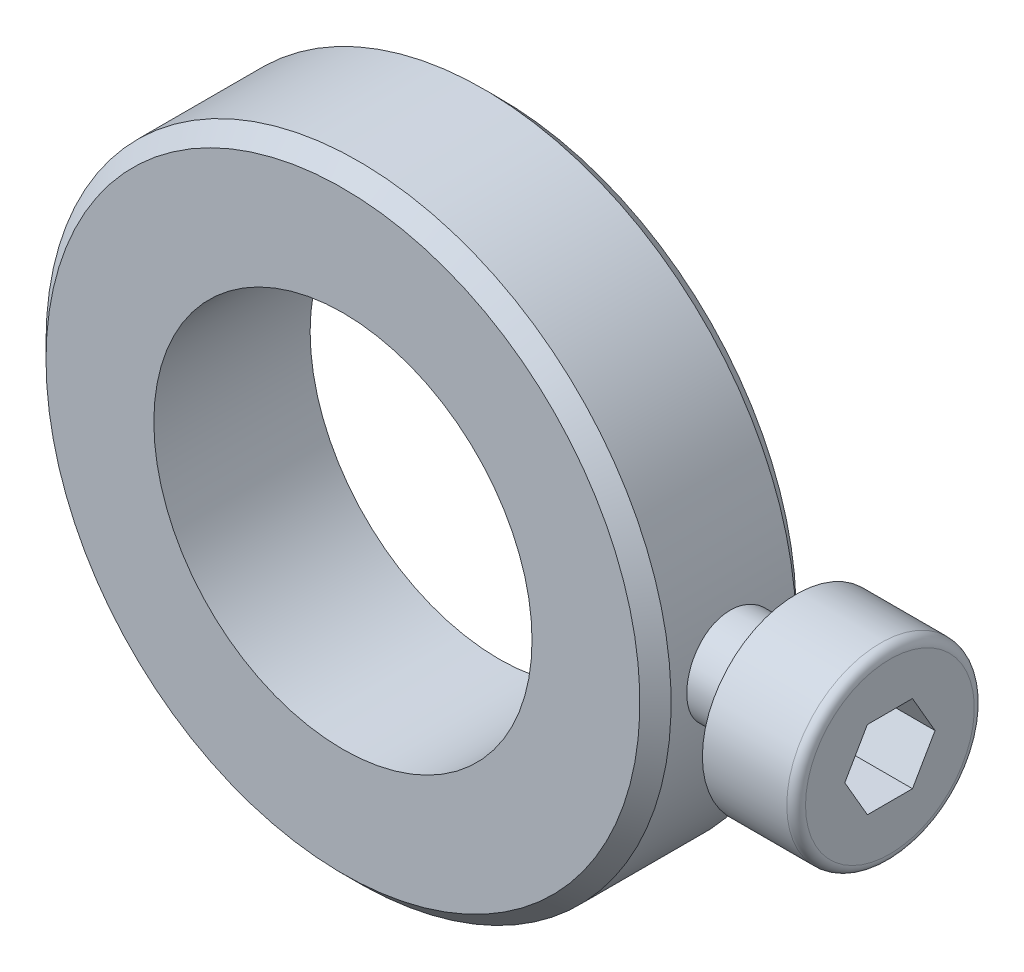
ISO-10303-21;
HEADER;
FILE_DESCRIPTION(('STEP AP214'),'2;1');
FILE_NAME('part.step','',(''),(''),'','','');
FILE_SCHEMA(('AUTOMOTIVE_DESIGN { 1 0 10303 214 1 1 1 1 }'));
ENDSEC;
DATA;
#1=APPLICATION_CONTEXT('core data for automotive mechanical design processes');
#2=APPLICATION_PROTOCOL_DEFINITION('international standard','automotive_design',2000,#1);
#3=PRODUCT_CONTEXT('',#1,'mechanical');
#4=PRODUCT('Part','Part','',(#3));
#5=PRODUCT_RELATED_PRODUCT_CATEGORY('part','',(#4));
#6=PRODUCT_DEFINITION_FORMATION('','',#4);
#7=PRODUCT_DEFINITION_CONTEXT('part definition',#1,'design');
#8=PRODUCT_DEFINITION('design','',#6,#7);
#9=PRODUCT_DEFINITION_SHAPE('','',#8);
#10=(LENGTH_UNIT() NAMED_UNIT(*) SI_UNIT(.MILLI.,.METRE.));
#11=(NAMED_UNIT(*) PLANE_ANGLE_UNIT() SI_UNIT($,.RADIAN.));
#12=(NAMED_UNIT(*) SI_UNIT($,.STERADIAN.) SOLID_ANGLE_UNIT());
#13=UNCERTAINTY_MEASURE_WITH_UNIT(LENGTH_MEASURE(1.E-05),#10,'distance_accuracy_value','');
#14=(GEOMETRIC_REPRESENTATION_CONTEXT(3) GLOBAL_UNCERTAINTY_ASSIGNED_CONTEXT((#13)) GLOBAL_UNIT_ASSIGNED_CONTEXT((#10,
#11,#12)) REPRESENTATION_CONTEXT('',''));
#15=CARTESIAN_POINT('',(0.,0.,0.));
#16=DIRECTION('',(0.,0.,1.));
#17=DIRECTION('',(1.,0.,0.));
#18=AXIS2_PLACEMENT_3D('',#15,#16,#17);
#19=CARTESIAN_POINT('',(0.,0.,-2.5));
#20=DIRECTION('',(0.,0.,1.));
#21=DIRECTION('',(1.,0.,0.));
#22=AXIS2_PLACEMENT_3D('',#19,#20,#21);
#23=CYLINDRICAL_SURFACE('',#22,10.);
#24=CARTESIAN_POINT('',(0.,0.,-1.99999999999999));
#25=DIRECTION('',(0.,0.,-1.));
#26=DIRECTION('',(-1.,0.,0.));
#27=AXIS2_PLACEMENT_3D('',#24,#25,#26);
#28=CIRCLE('',#27,10.);
#29=CARTESIAN_POINT('',(-10.,0.,-1.99999999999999));
#30=VERTEX_POINT('',#29);
#31=EDGE_CURVE('E166',#30,#30,#28,.F.);
#32=ORIENTED_EDGE('',*,*,#31,.T.);
#33=EDGE_LOOP('',(#32));
#34=FACE_BOUND('',#33,.T.);
#35=CARTESIAN_POINT('',(0.,0.,1.99999999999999));
#36=DIRECTION('',(0.,0.,-1.));
#37=DIRECTION('',(-1.,0.,0.));
#38=AXIS2_PLACEMENT_3D('',#35,#36,#37);
#39=CIRCLE('',#38,10.);
#40=CARTESIAN_POINT('',(-10.,0.,1.99999999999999));
#41=VERTEX_POINT('',#40);
#42=EDGE_CURVE('E44',#41,#41,#39,.T.);
#43=ORIENTED_EDGE('',*,*,#42,.T.);
#44=EDGE_LOOP('',(#43));
#45=FACE_BOUND('',#44,.T.);
#46=CARTESIAN_POINT('',(10.,0.,-1.5));
#47=CARTESIAN_POINT('',(9.99999865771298,-0.0837515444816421,-1.49999654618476));
#48=CARTESIAN_POINT('',(9.99893682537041,-0.167551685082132,-1.49296199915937));
#49=CARTESIAN_POINT('',(9.99480315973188,-0.332809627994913,-1.46501680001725));
#50=CARTESIAN_POINT('',(9.99172936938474,-0.414265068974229,-1.44409263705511));
#51=CARTESIAN_POINT('',(9.98391721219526,-0.57241808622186,-1.38900749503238));
#52=CARTESIAN_POINT('',(9.9791801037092,-0.649119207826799,-1.35485652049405));
#53=CARTESIAN_POINT('',(9.96856475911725,-0.795690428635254,-1.27431162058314));
#54=CARTESIAN_POINT('',(9.96268668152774,-0.865561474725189,-1.22791939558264));
#55=CARTESIAN_POINT('',(9.95039170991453,-0.997046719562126,-1.12382273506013));
#56=CARTESIAN_POINT('',(9.94397133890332,-1.0585998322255,-1.0660415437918));
#57=CARTESIAN_POINT('',(9.93134261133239,-1.17117490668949,-0.940972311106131));
#58=CARTESIAN_POINT('',(9.92513426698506,-1.22219626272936,-0.873683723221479));
#59=CARTESIAN_POINT('',(9.91359877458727,-1.31249729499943,-0.731099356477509));
#60=CARTESIAN_POINT('',(9.90827611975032,-1.35171787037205,-0.655765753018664));
#61=CARTESIAN_POINT('',(9.89916211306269,-1.41692632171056,-0.499487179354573));
#62=CARTESIAN_POINT('',(9.89537067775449,-1.44291491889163,-0.418542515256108));
#63=CARTESIAN_POINT('',(9.88978256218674,-1.48073198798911,-0.253981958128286));
#64=CARTESIAN_POINT('',(9.88797115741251,-1.49266503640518,-0.170390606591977));
#65=CARTESIAN_POINT('',(9.88650348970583,-1.50235624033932,-0.0023738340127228));
#66=CARTESIAN_POINT('',(9.88684710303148,-1.50011520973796,0.0820515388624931));
#67=CARTESIAN_POINT('',(9.8896371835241,-1.48160733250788,0.248601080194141));
#68=CARTESIAN_POINT('',(9.8920661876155,-1.4654569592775,0.330738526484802));
#69=CARTESIAN_POINT('',(9.89872608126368,-1.41977117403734,0.49112436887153));
#70=CARTESIAN_POINT('',(9.9029570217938,-1.39023538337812,0.569372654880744));
#71=CARTESIAN_POINT('',(9.91276335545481,-1.31849603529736,0.720113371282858));
#72=CARTESIAN_POINT('',(9.91834396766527,-1.27624314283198,0.79258196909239));
#73=CARTESIAN_POINT('',(9.93021707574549,-1.18030413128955,0.929444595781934));
#74=CARTESIAN_POINT('',(9.93650961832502,-1.12661726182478,0.993838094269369));
#75=CARTESIAN_POINT('',(9.9491747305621,-1.00869493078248,1.11339766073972));
#76=CARTESIAN_POINT('',(9.95554747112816,-0.944359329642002,1.16846499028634));
#77=CARTESIAN_POINT('',(9.96759647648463,-0.807307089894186,1.26703593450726));
#78=CARTESIAN_POINT('',(9.97327273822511,-0.73459041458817,1.3105394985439));
#79=CARTESIAN_POINT('',(9.98329515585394,-0.582754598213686,1.38475308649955));
#80=CARTESIAN_POINT('',(9.98764051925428,-0.50363167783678,1.4154554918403));
#81=CARTESIAN_POINT('',(9.9945049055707,-0.341273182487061,1.46310938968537));
#82=CARTESIAN_POINT('',(9.99702405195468,-0.258037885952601,1.48006181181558));
#83=CARTESIAN_POINT('',(9.99993581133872,-0.0906695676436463,1.49960322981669));
#84=CARTESIAN_POINT('',(10.0003485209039,-0.00655273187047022,1.50232797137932));
#85=CARTESIAN_POINT('',(9.99905561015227,0.160936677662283,1.49369699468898));
#86=CARTESIAN_POINT('',(9.99735005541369,0.244309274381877,1.4823417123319));
#87=CARTESIAN_POINT('',(9.99202468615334,0.407532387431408,1.44598589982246));
#88=CARTESIAN_POINT('',(9.98841415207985,0.487397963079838,1.42105150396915));
#89=CARTESIAN_POINT('',(9.9796823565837,0.641814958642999,1.35831500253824));
#90=CARTESIAN_POINT('',(9.97456102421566,0.7163661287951,1.32051229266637));
#91=CARTESIAN_POINT('',(9.96332682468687,0.858634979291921,1.23279377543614));
#92=CARTESIAN_POINT('',(9.95720701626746,0.926299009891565,1.18279185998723));
#93=CARTESIAN_POINT('',(9.94467863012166,1.05232367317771,1.07221418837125));
#94=CARTESIAN_POINT('',(9.93827003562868,1.1106837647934,1.01163781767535));
#95=CARTESIAN_POINT('',(9.92582264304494,1.21693784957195,0.881026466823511));
#96=CARTESIAN_POINT('',(9.91978736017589,1.26474084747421,0.810917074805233));
#97=CARTESIAN_POINT('',(9.90883219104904,1.34789129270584,0.663583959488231));
#98=CARTESIAN_POINT('',(9.90391227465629,1.38323907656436,0.586360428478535));
#99=CARTESIAN_POINT('',(9.89577033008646,1.44033467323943,0.427262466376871));
#100=CARTESIAN_POINT('',(9.89254233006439,1.46213037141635,0.345405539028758));
#101=CARTESIAN_POINT('',(9.88813382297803,1.49165549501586,0.179140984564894));
#102=CARTESIAN_POINT('',(9.88695317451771,1.49938589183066,0.0947335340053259));
#103=CARTESIAN_POINT('',(9.88677832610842,1.5005378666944,-0.0733290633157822));
#104=CARTESIAN_POINT('',(9.88776226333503,1.49410252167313,-0.156983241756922));
#105=CARTESIAN_POINT('',(9.89175820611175,1.46741229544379,-0.322005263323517));
#106=CARTESIAN_POINT('',(9.89477020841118,1.44715743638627,-0.403373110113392));
#107=CARTESIAN_POINT('',(9.90247526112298,1.39345373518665,-0.561473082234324));
#108=CARTESIAN_POINT('',(9.90716703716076,1.36001489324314,-0.638208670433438));
#109=CARTESIAN_POINT('',(9.91770454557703,1.28090667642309,-0.7850036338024));
#110=CARTESIAN_POINT('',(9.92355031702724,1.23523688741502,-0.855062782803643));
#111=CARTESIAN_POINT('',(9.93580743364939,1.13244337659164,-0.987243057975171));
#112=CARTESIAN_POINT('',(9.94222367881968,1.07521369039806,-1.04928133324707));
#113=CARTESIAN_POINT('',(9.95485788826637,0.951148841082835,-1.16292455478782));
#114=CARTESIAN_POINT('',(9.9610758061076,0.884311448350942,-1.21452707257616));
#115=CARTESIAN_POINT('',(9.97265185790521,0.742495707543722,-1.30608767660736));
#116=CARTESIAN_POINT('',(9.97800507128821,0.667474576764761,-1.34598010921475));
#117=CARTESIAN_POINT('',(9.9872002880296,0.51175187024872,-1.41253851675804));
#118=CARTESIAN_POINT('',(9.99104385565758,0.431056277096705,-1.43921819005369));
#119=CARTESIAN_POINT('',(9.99590939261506,0.291665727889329,-1.47254134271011));
#120=CARTESIAN_POINT('',(9.99743549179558,0.233831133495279,-1.48282260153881));
#121=CARTESIAN_POINT('',(9.99948125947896,0.117338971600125,-1.49655309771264));
#122=CARTESIAN_POINT('',(10.0000009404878,0.0586814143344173,-1.50000241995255));
#123=CARTESIAN_POINT('',(10.,0.,-1.5));
#124=B_SPLINE_CURVE_WITH_KNOTS('',3,(#46,#47,#48,#49,#50,#51,#52,#53,#54,#55,#56,#57,#58,#59,
#60,#61,#62,#63,#64,#65,#66,#67,#68,#69,#70,#71,#72,#73,#74,#75,#76,#77,#78,#79,#80,#81,#82,#83,
#84,#85,#86,#87,#88,#89,#90,#91,#92,#93,#94,#95,#96,#97,#98,#99,#100,#101,#102,#103,#104,#105,
#106,#107,#108,#109,#110,#111,#112,#113,#114,#115,#116,#117,#118,#119,#120,#121,#122,#123),
.UNSPECIFIED.,.T.,.F.,(4,2,2,2,2,2,2,2,2,2,2,2,2,2,2,2,2,2,2,2,2,2,2,2,2,2,2,2,2,2,2,2,2,2,2,2,
2,2,4),(0.,0.251040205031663,0.50232496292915,0.753420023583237,1.0044802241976,
1.25729416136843,1.5101226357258,1.76419702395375,2.01825756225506,2.27041564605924,
2.52255925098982,2.77261177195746,3.02267136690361,3.27371383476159,3.52477278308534,
3.77834291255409,4.03191415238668,4.28563608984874,4.53934087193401,4.79062058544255,
5.04189251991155,5.29195148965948,5.54202220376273,5.79391188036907,6.0458162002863,
6.29981366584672,6.55380426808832,6.80689223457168,7.05996272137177,7.31048888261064,
7.56101464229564,7.81135073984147,8.06169531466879,8.31444829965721,8.56726003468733,
8.82146323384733,9.07540233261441,9.25129851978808,9.42719252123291),.UNSPECIFIED.);
#125=CARTESIAN_POINT('',(10.,0.,-1.5));
#126=VERTEX_POINT('',#125);
#127=EDGE_CURVE('E36',#126,#126,#124,.T.);
#128=ORIENTED_EDGE('',*,*,#127,.T.);
#129=EDGE_LOOP('',(#128));
#130=FACE_BOUND('',#129,.T.);
#131=ADVANCED_FACE('F32',(#34,#45,#130),#23,.T.);
#132=CARTESIAN_POINT('',(0.,0.,-2.5));
#133=DIRECTION('',(0.,0.,-1.));
#134=DIRECTION('',(-1.,0.,0.));
#135=AXIS2_PLACEMENT_3D('',#132,#133,#134);
#136=PLANE('',#135);
#137=CARTESIAN_POINT('',(0.,0.,-2.5));
#138=DIRECTION('',(0.,0.,1.));
#139=DIRECTION('',(1.,0.,0.));
#140=AXIS2_PLACEMENT_3D('',#137,#138,#139);
#141=CIRCLE('',#140,6.05000000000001);
#142=CARTESIAN_POINT('',(6.05000000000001,0.,-2.5));
#143=VERTEX_POINT('',#142);
#144=EDGE_CURVE('E160',#143,#143,#141,.T.);
#145=ORIENTED_EDGE('',*,*,#144,.T.);
#146=EDGE_LOOP('',(#145));
#147=FACE_BOUND('',#146,.T.);
#148=CARTESIAN_POINT('',(0.,0.,-2.5));
#149=DIRECTION('',(0.,0.,-1.));
#150=DIRECTION('',(-1.,0.,0.));
#151=AXIS2_PLACEMENT_3D('',#148,#149,#150);
#152=CIRCLE('',#151,9.50000000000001);
#153=CARTESIAN_POINT('',(-9.50000000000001,0.,-2.5));
#154=VERTEX_POINT('',#153);
#155=EDGE_CURVE('E11',#154,#154,#152,.T.);
#156=ORIENTED_EDGE('',*,*,#155,.T.);
#157=EDGE_LOOP('',(#156));
#158=FACE_BOUND('',#157,.T.);
#159=ADVANCED_FACE('F183',(#147,#158),#136,.T.);
#160=CARTESIAN_POINT('',(0.,0.,2.5));
#161=DIRECTION('',(0.,0.,-1.));
#162=DIRECTION('',(-1.,0.,0.));
#163=AXIS2_PLACEMENT_3D('',#160,#161,#162);
#164=PLANE('',#163);
#165=CARTESIAN_POINT('',(0.,0.,2.5));
#166=DIRECTION('',(0.,0.,1.));
#167=DIRECTION('',(1.,0.,0.));
#168=AXIS2_PLACEMENT_3D('',#165,#166,#167);
#169=CIRCLE('',#168,6.05000000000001);
#170=CARTESIAN_POINT('',(6.05000000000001,0.,2.5));
#171=VERTEX_POINT('',#170);
#172=EDGE_CURVE('E157',#171,#171,#169,.T.);
#173=ORIENTED_EDGE('',*,*,#172,.F.);
#174=EDGE_LOOP('',(#173));
#175=FACE_BOUND('',#174,.T.);
#176=CARTESIAN_POINT('',(0.,0.,2.5));
#177=DIRECTION('',(0.,0.,-1.));
#178=DIRECTION('',(-1.,0.,0.));
#179=AXIS2_PLACEMENT_3D('',#176,#177,#178);
#180=CIRCLE('',#179,9.50000000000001);
#181=CARTESIAN_POINT('',(-9.50000000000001,0.,2.5));
#182=VERTEX_POINT('',#181);
#183=EDGE_CURVE('E163',#182,#182,#180,.F.);
#184=ORIENTED_EDGE('',*,*,#183,.T.);
#185=EDGE_LOOP('',(#184));
#186=FACE_BOUND('',#185,.T.);
#187=ADVANCED_FACE('F178',(#175,#186),#164,.F.);
#188=CARTESIAN_POINT('',(0.,0.,2.5));
#189=DIRECTION('',(0.,0.,-1.));
#190=DIRECTION('',(-1.,0.,0.));
#191=AXIS2_PLACEMENT_3D('',#188,#189,#190);
#192=CONICAL_SURFACE('',#191,9.50000000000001,0.785398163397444);
#193=ORIENTED_EDGE('',*,*,#42,.F.);
#194=EDGE_LOOP('',(#193));
#195=FACE_BOUND('',#194,.T.);
#196=ORIENTED_EDGE('',*,*,#183,.F.);
#197=EDGE_LOOP('',(#196));
#198=FACE_BOUND('',#197,.T.);
#199=ADVANCED_FACE('F174',(#195,#198),#192,.T.);
#200=CARTESIAN_POINT('',(0.,0.,-1.99999999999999));
#201=DIRECTION('',(0.,0.,1.));
#202=DIRECTION('',(1.,0.,0.));
#203=AXIS2_PLACEMENT_3D('',#200,#201,#202);
#204=CONICAL_SURFACE('',#203,10.,0.785398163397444);
#205=ORIENTED_EDGE('',*,*,#155,.F.);
#206=EDGE_LOOP('',(#205));
#207=FACE_BOUND('',#206,.T.);
#208=ORIENTED_EDGE('',*,*,#31,.F.);
#209=EDGE_LOOP('',(#208));
#210=FACE_BOUND('',#209,.T.);
#211=ADVANCED_FACE('F177',(#207,#210),#204,.T.);
#212=CARTESIAN_POINT('',(0.,0.,-2.5));
#213=DIRECTION('',(0.,0.,1.));
#214=DIRECTION('',(1.,0.,0.));
#215=AXIS2_PLACEMENT_3D('',#212,#213,#214);
#216=CYLINDRICAL_SURFACE('',#215,6.05000000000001);
#217=ORIENTED_EDGE('',*,*,#144,.F.);
#218=EDGE_LOOP('',(#217));
#219=FACE_BOUND('',#218,.T.);
#220=ORIENTED_EDGE('',*,*,#172,.T.);
#221=EDGE_LOOP('',(#220));
#222=FACE_BOUND('',#221,.T.);
#223=ADVANCED_FACE('F198',(#219,#222),#216,.F.);
#224=CARTESIAN_POINT('',(0.,0.,0.));
#225=DIRECTION('',(-1.,0.,0.));
#226=DIRECTION('',(0.,0.,1.));
#227=AXIS2_PLACEMENT_3D('',#224,#225,#226);
#228=CYLINDRICAL_SURFACE('',#227,1.5);
#229=ORIENTED_EDGE('',*,*,#127,.F.);
#230=EDGE_LOOP('',(#229));
#231=FACE_BOUND('',#230,.T.);
#232=CARTESIAN_POINT('',(12.,0.,0.));
#233=DIRECTION('',(-1.,0.,0.));
#234=DIRECTION('',(0.,0.,1.));
#235=AXIS2_PLACEMENT_3D('',#232,#233,#234);
#236=CIRCLE('',#235,1.5);
#237=CARTESIAN_POINT('',(12.,0.,1.5));
#238=VERTEX_POINT('',#237);
#239=EDGE_CURVE('E154',#238,#238,#236,.T.);
#240=ORIENTED_EDGE('',*,*,#239,.T.);
#241=EDGE_LOOP('',(#240));
#242=FACE_BOUND('',#241,.T.);
#243=ADVANCED_FACE('F204',(#231,#242),#228,.T.);
#244=CARTESIAN_POINT('',(12.,1.5,0.));
#245=DIRECTION('',(1.,0.,0.));
#246=DIRECTION('',(0.,0.,-1.));
#247=AXIS2_PLACEMENT_3D('',#244,#245,#246);
#248=PLANE('',#247);
#249=ORIENTED_EDGE('',*,*,#239,.F.);
#250=EDGE_LOOP('',(#249));
#251=FACE_BOUND('',#250,.T.);
#252=CARTESIAN_POINT('',(12.,0.,0.));
#253=DIRECTION('',(-1.,0.,0.));
#254=DIRECTION('',(0.,0.,1.));
#255=AXIS2_PLACEMENT_3D('',#252,#253,#254);
#256=CIRCLE('',#255,3.);
#257=CARTESIAN_POINT('',(12.,0.,3.));
#258=VERTEX_POINT('',#257);
#259=EDGE_CURVE('E151',#258,#258,#256,.T.);
#260=ORIENTED_EDGE('',*,*,#259,.T.);
#261=EDGE_LOOP('',(#260));
#262=FACE_BOUND('',#261,.T.);
#263=ADVANCED_FACE('F211',(#251,#262),#248,.F.);
#264=CARTESIAN_POINT('',(0.,0.,0.));
#265=DIRECTION('',(-1.,0.,0.));
#266=DIRECTION('',(0.,0.,1.));
#267=AXIS2_PLACEMENT_3D('',#264,#265,#266);
#268=CYLINDRICAL_SURFACE('',#267,3.);
#269=ORIENTED_EDGE('',*,*,#259,.F.);
#270=EDGE_LOOP('',(#269));
#271=FACE_BOUND('',#270,.T.);
#272=CARTESIAN_POINT('',(14.7,0.,0.));
#273=DIRECTION('',(-1.,0.,0.));
#274=DIRECTION('',(0.,0.,1.));
#275=AXIS2_PLACEMENT_3D('',#272,#273,#274);
#276=CIRCLE('',#275,3.);
#277=CARTESIAN_POINT('',(14.7,0.,3.));
#278=VERTEX_POINT('',#277);
#279=EDGE_CURVE('E148',#278,#278,#276,.T.);
#280=ORIENTED_EDGE('',*,*,#279,.T.);
#281=EDGE_LOOP('',(#280));
#282=FACE_BOUND('',#281,.T.);
#283=ADVANCED_FACE('F215',(#271,#282),#268,.T.);
#284=CARTESIAN_POINT('',(14.7,0.,0.));
#285=DIRECTION('',(-1.,0.,0.));
#286=DIRECTION('',(0.,0.,1.));
#287=AXIS2_PLACEMENT_3D('',#284,#285,#286);
#288=TOROIDAL_SURFACE('',#287,2.7,0.300000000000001);
#289=ORIENTED_EDGE('',*,*,#279,.F.);
#290=EDGE_LOOP('',(#289));
#291=FACE_BOUND('',#290,.T.);
#292=CARTESIAN_POINT('',(15.,0.,0.));
#293=DIRECTION('',(-1.,0.,0.));
#294=DIRECTION('',(0.,0.,1.));
#295=AXIS2_PLACEMENT_3D('',#292,#293,#294);
#296=CIRCLE('',#295,2.7);
#297=CARTESIAN_POINT('',(15.,0.,2.7));
#298=VERTEX_POINT('',#297);
#299=EDGE_CURVE('E139',#298,#298,#296,.T.);
#300=ORIENTED_EDGE('',*,*,#299,.T.);
#301=EDGE_LOOP('',(#300));
#302=FACE_BOUND('',#301,.T.);
#303=ADVANCED_FACE('F219',(#291,#302),#288,.T.);
#304=CARTESIAN_POINT('',(15.,2.7,0.));
#305=DIRECTION('',(-1.,0.,0.));
#306=DIRECTION('',(0.,0.,1.));
#307=AXIS2_PLACEMENT_3D('',#304,#305,#306);
#308=PLANE('',#307);
#309=DIRECTION('',(0.,0.866460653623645,-0.49924536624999));
#310=VECTOR('',#309,1.);
#311=CARTESIAN_POINT('',(15.,-1.24937082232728,-0.722776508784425));
#312=LINE('',#311,#310);
#313=CARTESIAN_POINT('',(15.,-1.24937082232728,-0.722776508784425));
#314=VERTEX_POINT('',#313);
#315=CARTESIAN_POINT('',(15.,0.00125740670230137,-1.44337512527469));
#316=VERTEX_POINT('',#315);
#317=EDGE_CURVE('E105',#314,#316,#312,.T.);
#318=ORIENTED_EDGE('',*,*,#317,.F.);
#319=DIRECTION('',(0.,0.000871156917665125,-0.99999962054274));
#320=VECTOR('',#319,1.);
#321=CARTESIAN_POINT('',(15.,-1.25062822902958,0.720598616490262));
#322=LINE('',#321,#320);
#323=CARTESIAN_POINT('',(15.,-1.25062822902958,0.720598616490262));
#324=VERTEX_POINT('',#323);
#325=EDGE_CURVE('E51',#324,#314,#322,.T.);
#326=ORIENTED_EDGE('',*,*,#325,.F.);
#327=DIRECTION('',(0.,-0.86558949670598,-0.500754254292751));
#328=VECTOR('',#327,1.);
#329=CARTESIAN_POINT('',(15.,-0.00125740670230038,1.44337512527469));
#330=LINE('',#329,#328);
#331=CARTESIAN_POINT('',(15.,-0.00125740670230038,1.44337512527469));
#332=VERTEX_POINT('',#331);
#333=EDGE_CURVE('E121',#332,#324,#330,.T.);
#334=ORIENTED_EDGE('',*,*,#333,.F.);
#335=DIRECTION('',(0.,-0.866460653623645,0.49924536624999));
#336=VECTOR('',#335,1.);
#337=CARTESIAN_POINT('',(15.,1.24937082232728,0.722776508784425));
#338=LINE('',#337,#336);
#339=CARTESIAN_POINT('',(15.,1.24937082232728,0.722776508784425));
#340=VERTEX_POINT('',#339);
#341=EDGE_CURVE('E115',#340,#332,#338,.T.);
#342=ORIENTED_EDGE('',*,*,#341,.F.);
#343=DIRECTION('',(0.,-0.000871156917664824,0.99999962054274));
#344=VECTOR('',#343,1.);
#345=CARTESIAN_POINT('',(15.,1.25062822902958,-0.720598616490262));
#346=LINE('',#345,#344);
#347=CARTESIAN_POINT('',(15.,1.25062822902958,-0.720598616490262));
#348=VERTEX_POINT('',#347);
#349=EDGE_CURVE('E113',#348,#340,#346,.T.);
#350=ORIENTED_EDGE('',*,*,#349,.F.);
#351=DIRECTION('',(0.,0.86558949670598,0.500754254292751));
#352=VECTOR('',#351,1.);
#353=CARTESIAN_POINT('',(15.,0.00125740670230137,-1.44337512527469));
#354=LINE('',#353,#352);
#355=EDGE_CURVE('E94',#316,#348,#354,.T.);
#356=ORIENTED_EDGE('',*,*,#355,.F.);
#357=EDGE_LOOP('',(#318,#326,#334,#342,#350,#356));
#358=FACE_BOUND('',#357,.T.);
#359=ORIENTED_EDGE('',*,*,#299,.F.);
#360=EDGE_LOOP('',(#359));
#361=FACE_BOUND('',#360,.T.);
#362=ADVANCED_FACE('F109',(#358,#361),#308,.F.);
#363=CARTESIAN_POINT('',(13.,-1.25062822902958,0.720598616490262));
#364=DIRECTION('',(0.,-0.99999962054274,-0.000871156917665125));
#365=DIRECTION('',(0.,0.000871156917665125,-0.99999962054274));
#366=AXIS2_PLACEMENT_3D('',#363,#364,#365);
#367=PLANE('',#366);
#368=ORIENTED_EDGE('',*,*,#325,.T.);
#369=DIRECTION('',(1.,0.,0.));
#370=VECTOR('',#369,1.);
#371=CARTESIAN_POINT('',(13.,-1.24937082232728,-0.722776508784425));
#372=LINE('',#371,#370);
#373=CARTESIAN_POINT('',(13.,-1.24937082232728,-0.722776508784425));
#374=VERTEX_POINT('',#373);
#375=EDGE_CURVE('E102',#374,#314,#372,.T.);
#376=ORIENTED_EDGE('',*,*,#375,.F.);
#377=DIRECTION('',(0.,0.000871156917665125,-0.99999962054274));
#378=VECTOR('',#377,1.);
#379=CARTESIAN_POINT('',(13.,-1.25062822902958,0.720598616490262));
#380=LINE('',#379,#378);
#381=CARTESIAN_POINT('',(13.,-1.25062822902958,0.720598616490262));
#382=VERTEX_POINT('',#381);
#383=EDGE_CURVE('E123',#382,#374,#380,.T.);
#384=ORIENTED_EDGE('',*,*,#383,.F.);
#385=DIRECTION('',(1.,0.,0.));
#386=VECTOR('',#385,1.);
#387=CARTESIAN_POINT('',(13.,-1.25062822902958,0.720598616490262));
#388=LINE('',#387,#386);
#389=EDGE_CURVE('E58',#382,#324,#388,.T.);
#390=ORIENTED_EDGE('',*,*,#389,.T.);
#391=EDGE_LOOP('',(#368,#376,#384,#390));
#392=FACE_BOUND('',#391,.T.);
#393=ADVANCED_FACE('F226',(#392),#367,.F.);
#394=CARTESIAN_POINT('',(13.,-0.00125740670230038,1.44337512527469));
#395=DIRECTION('',(0.,-0.500754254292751,0.86558949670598));
#396=DIRECTION('',(0.,-0.86558949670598,-0.500754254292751));
#397=AXIS2_PLACEMENT_3D('',#394,#395,#396);
#398=PLANE('',#397);
#399=ORIENTED_EDGE('',*,*,#333,.T.);
#400=ORIENTED_EDGE('',*,*,#389,.F.);
#401=DIRECTION('',(0.,-0.86558949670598,-0.500754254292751));
#402=VECTOR('',#401,1.);
#403=CARTESIAN_POINT('',(13.,-0.00125740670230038,1.44337512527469));
#404=LINE('',#403,#402);
#405=CARTESIAN_POINT('',(13.,-0.00125740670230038,1.44337512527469));
#406=VERTEX_POINT('',#405);
#407=EDGE_CURVE('E135',#406,#382,#404,.T.);
#408=ORIENTED_EDGE('',*,*,#407,.F.);
#409=DIRECTION('',(1.,0.,0.));
#410=VECTOR('',#409,1.);
#411=CARTESIAN_POINT('',(13.,-0.00125740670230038,1.44337512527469));
#412=LINE('',#411,#410);
#413=EDGE_CURVE('E140',#406,#332,#412,.T.);
#414=ORIENTED_EDGE('',*,*,#413,.T.);
#415=EDGE_LOOP('',(#399,#400,#408,#414));
#416=FACE_BOUND('',#415,.T.);
#417=ADVANCED_FACE('F229',(#416),#398,.F.);
#418=CARTESIAN_POINT('',(13.,1.24937082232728,0.722776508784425));
#419=DIRECTION('',(0.,0.49924536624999,0.866460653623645));
#420=DIRECTION('',(0.,-0.866460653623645,0.49924536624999));
#421=AXIS2_PLACEMENT_3D('',#418,#419,#420);
#422=PLANE('',#421);
#423=ORIENTED_EDGE('',*,*,#341,.T.);
#424=ORIENTED_EDGE('',*,*,#413,.F.);
#425=DIRECTION('',(0.,-0.866460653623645,0.49924536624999));
#426=VECTOR('',#425,1.);
#427=CARTESIAN_POINT('',(13.,1.24937082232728,0.722776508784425));
#428=LINE('',#427,#426);
#429=CARTESIAN_POINT('',(13.,1.24937082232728,0.722776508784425));
#430=VERTEX_POINT('',#429);
#431=EDGE_CURVE('E132',#430,#406,#428,.T.);
#432=ORIENTED_EDGE('',*,*,#431,.F.);
#433=DIRECTION('',(1.,0.,0.));
#434=VECTOR('',#433,1.);
#435=CARTESIAN_POINT('',(13.,1.24937082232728,0.722776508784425));
#436=LINE('',#435,#434);
#437=EDGE_CURVE('E142',#430,#340,#436,.T.);
#438=ORIENTED_EDGE('',*,*,#437,.T.);
#439=EDGE_LOOP('',(#423,#424,#432,#438));
#440=FACE_BOUND('',#439,.T.);
#441=ADVANCED_FACE('F238',(#440),#422,.F.);
#442=CARTESIAN_POINT('',(13.,1.25062822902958,-0.720598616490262));
#443=DIRECTION('',(0.,0.99999962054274,0.000871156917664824));
#444=DIRECTION('',(0.,-0.000871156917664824,0.99999962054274));
#445=AXIS2_PLACEMENT_3D('',#442,#443,#444);
#446=PLANE('',#445);
#447=ORIENTED_EDGE('',*,*,#349,.T.);
#448=ORIENTED_EDGE('',*,*,#437,.F.);
#449=DIRECTION('',(0.,-0.000871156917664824,0.99999962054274));
#450=VECTOR('',#449,1.);
#451=CARTESIAN_POINT('',(13.,1.25062822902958,-0.720598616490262));
#452=LINE('',#451,#450);
#453=CARTESIAN_POINT('',(13.,1.25062822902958,-0.720598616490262));
#454=VERTEX_POINT('',#453);
#455=EDGE_CURVE('E129',#454,#430,#452,.T.);
#456=ORIENTED_EDGE('',*,*,#455,.F.);
#457=DIRECTION('',(1.,0.,0.));
#458=VECTOR('',#457,1.);
#459=CARTESIAN_POINT('',(13.,1.25062822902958,-0.720598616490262));
#460=LINE('',#459,#458);
#461=EDGE_CURVE('E101',#454,#348,#460,.T.);
#462=ORIENTED_EDGE('',*,*,#461,.T.);
#463=EDGE_LOOP('',(#447,#448,#456,#462));
#464=FACE_BOUND('',#463,.T.);
#465=ADVANCED_FACE('F235',(#464),#446,.F.);
#466=CARTESIAN_POINT('',(13.,0.00125740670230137,-1.44337512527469));
#467=DIRECTION('',(0.,0.500754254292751,-0.86558949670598));
#468=DIRECTION('',(0.,0.86558949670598,0.500754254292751));
#469=AXIS2_PLACEMENT_3D('',#466,#467,#468);
#470=PLANE('',#469);
#471=ORIENTED_EDGE('',*,*,#355,.T.);
#472=ORIENTED_EDGE('',*,*,#461,.F.);
#473=DIRECTION('',(0.,0.86558949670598,0.500754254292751));
#474=VECTOR('',#473,1.);
#475=CARTESIAN_POINT('',(13.,0.00125740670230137,-1.44337512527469));
#476=LINE('',#475,#474);
#477=CARTESIAN_POINT('',(13.,0.00125740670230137,-1.44337512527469));
#478=VERTEX_POINT('',#477);
#479=EDGE_CURVE('E97',#478,#454,#476,.T.);
#480=ORIENTED_EDGE('',*,*,#479,.F.);
#481=DIRECTION('',(1.,0.,0.));
#482=VECTOR('',#481,1.);
#483=CARTESIAN_POINT('',(13.,0.00125740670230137,-1.44337512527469));
#484=LINE('',#483,#482);
#485=EDGE_CURVE('E90',#478,#316,#484,.T.);
#486=ORIENTED_EDGE('',*,*,#485,.T.);
#487=EDGE_LOOP('',(#471,#472,#480,#486));
#488=FACE_BOUND('',#487,.T.);
#489=ADVANCED_FACE('F92',(#488),#470,.F.);
#490=CARTESIAN_POINT('',(13.,-1.24937082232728,-0.722776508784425));
#491=DIRECTION('',(0.,-0.49924536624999,-0.866460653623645));
#492=DIRECTION('',(0.,0.866460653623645,-0.49924536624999));
#493=AXIS2_PLACEMENT_3D('',#490,#491,#492);
#494=PLANE('',#493);
#495=ORIENTED_EDGE('',*,*,#317,.T.);
#496=ORIENTED_EDGE('',*,*,#485,.F.);
#497=DIRECTION('',(0.,0.866460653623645,-0.49924536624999));
#498=VECTOR('',#497,1.);
#499=CARTESIAN_POINT('',(13.,-1.24937082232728,-0.722776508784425));
#500=LINE('',#499,#498);
#501=EDGE_CURVE('E126',#374,#478,#500,.T.);
#502=ORIENTED_EDGE('',*,*,#501,.F.);
#503=ORIENTED_EDGE('',*,*,#375,.T.);
#504=EDGE_LOOP('',(#495,#496,#502,#503));
#505=FACE_BOUND('',#504,.T.);
#506=ADVANCED_FACE('F106',(#505),#494,.F.);
#507=CARTESIAN_POINT('',(13.,-1.24937082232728,-0.722776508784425));
#508=DIRECTION('',(1.,0.,0.));
#509=DIRECTION('',(0.,0.,-1.));
#510=AXIS2_PLACEMENT_3D('',#507,#508,#509);
#511=PLANE('',#510);
#512=ORIENTED_EDGE('',*,*,#383,.T.);
#513=ORIENTED_EDGE('',*,*,#501,.T.);
#514=ORIENTED_EDGE('',*,*,#479,.T.);
#515=ORIENTED_EDGE('',*,*,#455,.T.);
#516=ORIENTED_EDGE('',*,*,#431,.T.);
#517=ORIENTED_EDGE('',*,*,#407,.T.);
#518=EDGE_LOOP('',(#512,#513,#514,#515,#516,#517));
#519=FACE_BOUND('',#518,.T.);
#520=ADVANCED_FACE('F232',(#519),#511,.T.);
#521=CLOSED_SHELL('',(#131,#159,#187,#199,#211,#223,#243,#263,#283,#303,#362,#393,#417,#441,
#465,#489,#506,#520));
#522=MANIFOLD_SOLID_BREP('B2',#521);
#523=ADVANCED_BREP_SHAPE_REPRESENTATION('',(#18,#522),#14);
#524=SHAPE_DEFINITION_REPRESENTATION(#9,#523);
ENDSEC;
END-ISO-10303-21;
